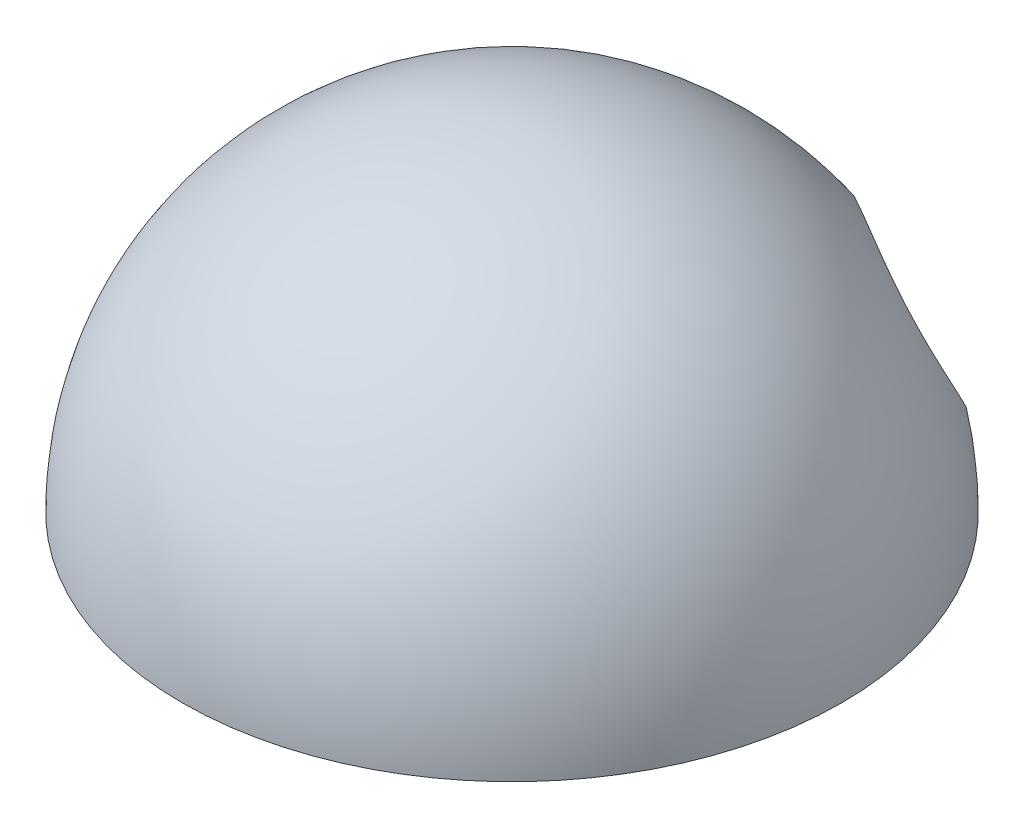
ISO-10303-21;
HEADER;
FILE_DESCRIPTION(('STEP AP214'),'2;1');
FILE_NAME('part.step','',(''),(''),'','','');
FILE_SCHEMA(('AUTOMOTIVE_DESIGN { 1 0 10303 214 1 1 1 1 }'));
ENDSEC;
DATA;
#1=APPLICATION_CONTEXT('core data for automotive mechanical design processes');
#2=APPLICATION_PROTOCOL_DEFINITION('international standard','automotive_design',2000,#1);
#3=PRODUCT_CONTEXT('',#1,'mechanical');
#4=PRODUCT('Part','Part','',(#3));
#5=PRODUCT_RELATED_PRODUCT_CATEGORY('part','',(#4));
#6=PRODUCT_DEFINITION_FORMATION('','',#4);
#7=PRODUCT_DEFINITION_CONTEXT('part definition',#1,'design');
#8=PRODUCT_DEFINITION('design','',#6,#7);
#9=PRODUCT_DEFINITION_SHAPE('','',#8);
#10=(LENGTH_UNIT() NAMED_UNIT(*) SI_UNIT(.MILLI.,.METRE.));
#11=(NAMED_UNIT(*) PLANE_ANGLE_UNIT() SI_UNIT($,.RADIAN.));
#12=(NAMED_UNIT(*) SI_UNIT($,.STERADIAN.) SOLID_ANGLE_UNIT());
#13=UNCERTAINTY_MEASURE_WITH_UNIT(LENGTH_MEASURE(1.E-05),#10,'distance_accuracy_value','');
#14=(GEOMETRIC_REPRESENTATION_CONTEXT(3) GLOBAL_UNCERTAINTY_ASSIGNED_CONTEXT((#13)) GLOBAL_UNIT_ASSIGNED_CONTEXT((#10,
#11,#12)) REPRESENTATION_CONTEXT('',''));
#15=CARTESIAN_POINT('',(0.,0.,0.));
#16=DIRECTION('',(0.,0.,1.));
#17=DIRECTION('',(1.,0.,0.));
#18=AXIS2_PLACEMENT_3D('',#15,#16,#17);
#19=CARTESIAN_POINT('',(0.,0.,0.));
#20=DIRECTION('',(0.,-1.,0.));
#21=DIRECTION('',(0.,0.,-1.));
#22=AXIS2_PLACEMENT_3D('',#19,#20,#21);
#23=PLANE('',#22);
#24=CARTESIAN_POINT('',(0.,0.,0.));
#25=DIRECTION('',(0.,-1.,0.));
#26=DIRECTION('',(0.,0.,-1.));
#27=AXIS2_PLACEMENT_3D('',#24,#25,#26);
#28=CIRCLE('',#27,32.5);
#29=CARTESIAN_POINT('',(0.,2.26946287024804E-13,-32.5));
#30=VERTEX_POINT('',#29);
#31=EDGE_CURVE('E11',#30,#30,#28,.T.);
#32=ORIENTED_EDGE('',*,*,#31,.T.);
#33=EDGE_LOOP('',(#32));
#34=FACE_BOUND('',#33,.T.);
#35=DIRECTION('',(-1.,0.,0.));
#36=VECTOR('',#35,1.);
#37=CARTESIAN_POINT('',(-31.,0.,0.));
#38=LINE('',#37,#36);
#39=CARTESIAN_POINT('',(31.,0.,0.));
#40=VERTEX_POINT('',#39);
#41=CARTESIAN_POINT('',(-31.,0.,0.));
#42=VERTEX_POINT('',#41);
#43=EDGE_CURVE('E56',#40,#42,#38,.T.);
#44=ORIENTED_EDGE('',*,*,#43,.T.);
#45=CARTESIAN_POINT('',(0.,0.,0.));
#46=DIRECTION('',(0.,1.,0.));
#47=DIRECTION('',(0.,0.,1.));
#48=AXIS2_PLACEMENT_3D('',#45,#46,#47);
#49=CIRCLE('',#48,31.);
#50=EDGE_CURVE('E65',#42,#40,#49,.T.);
#51=ORIENTED_EDGE('',*,*,#50,.T.);
#52=EDGE_LOOP('',(#44,#51));
#53=FACE_BOUND('',#52,.T.);
#54=ADVANCED_FACE('F33',(#34,#53),#23,.T.);
#55=CARTESIAN_POINT('',(0.,0.,0.));
#56=DIRECTION('',(-1.,0.,0.));
#57=DIRECTION('',(0.,0.,1.));
#58=AXIS2_PLACEMENT_3D('',#55,#56,#57);
#59=SPHERICAL_SURFACE('',#58,32.5);
#60=CARTESIAN_POINT('',(7.06318182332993,5.41689305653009,-31.2572988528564));
#61=CARTESIAN_POINT('',(7.22022770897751,5.26362528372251,-31.2483724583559));
#62=CARTESIAN_POINT('',(7.3830897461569,5.11656714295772,-31.2347396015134));
#63=CARTESIAN_POINT('',(7.71907827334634,4.83593278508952,-31.1982025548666));
#64=CARTESIAN_POINT('',(7.89220588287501,4.7023580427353,-31.1752973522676));
#65=CARTESIAN_POINT('',(8.24735063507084,4.44947766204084,-31.1204378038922));
#66=CARTESIAN_POINT('',(8.42937209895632,4.33017905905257,-31.0884790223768));
#67=CARTESIAN_POINT('',(8.8007100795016,4.10656095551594,-31.0158339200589));
#68=CARTESIAN_POINT('',(8.99002643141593,4.00224111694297,-30.9751477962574));
#69=CARTESIAN_POINT('',(9.37382142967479,3.8093033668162,-30.8855737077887));
#70=CARTESIAN_POINT('',(9.56828162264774,3.72063628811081,-30.8367123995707));
#71=CARTESIAN_POINT('',(9.96146026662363,3.55881155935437,-30.7311267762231));
#72=CARTESIAN_POINT('',(10.1601787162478,3.48565390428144,-30.6744024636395));
#73=CARTESIAN_POINT('',(10.5604106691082,3.35489611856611,-30.5535654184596));
#74=CARTESIAN_POINT('',(10.7619236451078,3.2972930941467,-30.4894540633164));
#75=CARTESIAN_POINT('',(11.1665037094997,3.19748663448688,-30.3542959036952));
#76=CARTESIAN_POINT('',(11.3695713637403,3.15528910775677,-30.2832464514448));
#77=CARTESIAN_POINT('',(11.7872542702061,3.08414737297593,-30.1305847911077));
#78=CARTESIAN_POINT('',(12.0018833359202,3.05607127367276,-30.0486048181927));
#79=CARTESIAN_POINT('',(12.4300732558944,3.01639967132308,-29.8780553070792));
#80=CARTESIAN_POINT('',(12.6436336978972,3.00481010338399,-29.7894834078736));
#81=CARTESIAN_POINT('',(13.2807703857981,2.99403870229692,-29.5147511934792));
#82=CARTESIAN_POINT('',(13.7010391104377,3.01881527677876,-29.3194874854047));
#83=CARTESIAN_POINT('',(14.5757426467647,3.1342541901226,-28.8833201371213));
#84=CARTESIAN_POINT('',(15.0277729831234,3.23285562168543,-28.6397677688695));
#85=CARTESIAN_POINT('',(15.9002162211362,3.49708222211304,-28.1331784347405));
#86=CARTESIAN_POINT('',(16.32061158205,3.66274425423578,-27.8701308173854));
#87=CARTESIAN_POINT('',(17.17898218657,4.08078181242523,-27.2916341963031));
#88=CARTESIAN_POINT('',(17.6111564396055,4.34205926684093,-26.9740095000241));
#89=CARTESIAN_POINT('',(18.4172687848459,4.93093495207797,-26.3266861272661));
#90=CARTESIAN_POINT('',(18.7911825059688,5.25856080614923,-25.9969824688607));
#91=CARTESIAN_POINT('',(19.5151117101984,6.012901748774,-25.2922654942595));
#92=CARTESIAN_POINT('',(19.8569829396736,6.4467699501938,-24.9165308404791));
#93=CARTESIAN_POINT('',(20.4520132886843,7.37430706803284,-24.166690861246));
#94=CARTESIAN_POINT('',(20.7050700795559,7.86804408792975,-23.7925879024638));
#95=CARTESIAN_POINT('',(21.0155596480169,8.65647107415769,-23.233250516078));
#96=CARTESIAN_POINT('',(21.1087583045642,8.93395148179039,-23.0429311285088));
#97=CARTESIAN_POINT('',(21.2667694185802,9.50073453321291,-22.667866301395));
#98=CARTESIAN_POINT('',(21.3315764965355,9.79003940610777,-22.4831219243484));
#99=CARTESIAN_POINT('',(21.4309260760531,10.3782636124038,-22.1218994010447));
#100=CARTESIAN_POINT('',(21.4655158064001,10.6771671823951,-21.9454087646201));
#101=CARTESIAN_POINT('',(21.50264421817,11.282859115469,-21.6033509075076));
#102=CARTESIAN_POINT('',(21.5052004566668,11.5896430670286,-21.4377777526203));
#103=CARTESIAN_POINT('',(21.4713145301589,12.3091074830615,-21.0696472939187));
#104=CARTESIAN_POINT('',(21.4220562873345,12.7240925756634,-20.8723373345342));
#105=CARTESIAN_POINT('',(21.2994467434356,13.3477337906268,-20.6027837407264));
#106=CARTESIAN_POINT('',(21.2504791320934,13.5557438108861,-20.5173567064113));
#107=CARTESIAN_POINT('',(21.1357231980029,13.9711064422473,-20.3566248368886));
#108=CARTESIAN_POINT('',(21.0699372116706,14.1784591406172,-20.281318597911));
#109=CARTESIAN_POINT('',(20.9332322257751,14.5573779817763,-20.153651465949));
#110=CARTESIAN_POINT('',(20.8648809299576,14.7292882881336,-20.099550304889));
#111=CARTESIAN_POINT('',(20.7160034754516,15.0704206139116,-20.0004172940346));
#112=CARTESIAN_POINT('',(20.6354797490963,15.2396431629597,-19.9553836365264));
#113=CARTESIAN_POINT('',(20.4623585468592,15.5741445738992,-19.8752348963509));
#114=CARTESIAN_POINT('',(20.3697659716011,15.739425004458,-19.8401158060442));
#115=CARTESIAN_POINT('',(20.172775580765,16.0648060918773,-19.7805001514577));
#116=CARTESIAN_POINT('',(20.0683776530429,16.2249066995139,-19.7560036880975));
#117=CARTESIAN_POINT('',(19.8478516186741,16.5392401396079,-19.7181058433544));
#118=CARTESIAN_POINT('',(19.7316752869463,16.6934449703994,-19.7047523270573));
#119=CARTESIAN_POINT('',(19.4887746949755,16.9939168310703,-19.689637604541));
#120=CARTESIAN_POINT('',(19.3620504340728,17.1401838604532,-19.6878763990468));
#121=CARTESIAN_POINT('',(19.099092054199,17.4235494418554,-19.6959890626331));
#122=CARTESIAN_POINT('',(18.9628581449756,17.5606481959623,-19.7058626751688));
#123=CARTESIAN_POINT('',(18.6820772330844,17.8246446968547,-19.7370059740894));
#124=CARTESIAN_POINT('',(18.5375304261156,17.9515426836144,-19.7582753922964));
#125=CARTESIAN_POINT('',(18.2513432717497,18.1862032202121,-19.8099221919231));
#126=CARTESIAN_POINT('',(18.1101573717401,18.2946782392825,-19.8395936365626));
#127=CARTESIAN_POINT('',(17.8226632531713,18.5016645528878,-19.9078787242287));
#128=CARTESIAN_POINT('',(17.6763531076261,18.600172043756,-19.9464957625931));
#129=CARTESIAN_POINT('',(17.3796664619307,18.7869232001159,-20.0320059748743));
#130=CARTESIAN_POINT('',(17.2292898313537,18.8751665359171,-20.078899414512));
#131=CARTESIAN_POINT('',(16.9253899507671,19.0413074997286,-20.1802466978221));
#132=CARTESIAN_POINT('',(16.7718661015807,19.1192031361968,-20.2347019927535));
#133=CARTESIAN_POINT('',(16.4093500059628,19.2896766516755,-20.3703307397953));
#134=CARTESIAN_POINT('',(16.1994241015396,19.3781028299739,-20.4542554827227));
#135=CARTESIAN_POINT('',(15.7771793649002,19.5366768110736,-20.6326859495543));
#136=CARTESIAN_POINT('',(15.5648599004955,19.6068196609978,-20.7271945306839));
#137=CARTESIAN_POINT('',(15.1389778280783,19.7294562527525,-20.9253173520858));
#138=CARTESIAN_POINT('',(14.9254138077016,19.7819226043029,-21.0289454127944));
#139=CARTESIAN_POINT('',(14.4985772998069,19.8696924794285,-21.2437191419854));
#140=CARTESIAN_POINT('',(14.2853048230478,19.9049953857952,-21.3548650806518));
#141=CARTESIAN_POINT('',(13.8034414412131,19.9662934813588,-21.6138074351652));
#142=CARTESIAN_POINT('',(13.5352244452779,19.9873157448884,-21.7634892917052));
#143=CARTESIAN_POINT('',(13.0024635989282,20.0041789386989,-22.0706465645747));
#144=CARTESIAN_POINT('',(12.7379208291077,20.0000126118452,-22.2281242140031));
#145=CARTESIAN_POINT('',(12.2138870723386,19.9676417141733,-22.5490339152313));
#146=CARTESIAN_POINT('',(11.9543976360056,19.9394298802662,-22.7124677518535));
#147=CARTESIAN_POINT('',(11.441831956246,19.8599861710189,-23.0436566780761));
#148=CARTESIAN_POINT('',(11.188755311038,19.8087557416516,-23.211411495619));
#149=CARTESIAN_POINT('',(10.6871595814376,19.6834221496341,-23.551952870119));
#150=CARTESIAN_POINT('',(10.4387324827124,19.609050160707,-23.7247757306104));
#151=CARTESIAN_POINT('',(9.95081749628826,19.4384683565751,-24.0722696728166));
#152=CARTESIAN_POINT('',(9.71133017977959,19.3422571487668,-24.2469408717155));
#153=CARTESIAN_POINT('',(9.24252693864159,19.1287438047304,-24.5970289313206));
#154=CARTESIAN_POINT('',(9.01321083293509,19.0114420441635,-24.7724457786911));
#155=CARTESIAN_POINT('',(8.56601429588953,18.7564471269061,-25.1230188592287));
#156=CARTESIAN_POINT('',(8.34813378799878,18.6187541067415,-25.2981750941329));
#157=CARTESIAN_POINT('',(7.90073179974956,18.3066277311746,-25.6674194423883));
#158=CARTESIAN_POINT('',(7.67276264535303,18.1297889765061,-25.8613629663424));
#159=CARTESIAN_POINT('',(7.23466649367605,17.7525583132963,-26.246464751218));
#160=CARTESIAN_POINT('',(7.02453887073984,17.5521672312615,-26.4376231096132));
#161=CARTESIAN_POINT('',(6.62410040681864,17.1287526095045,-26.8160006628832));
#162=CARTESIAN_POINT('',(6.43380114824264,16.9057159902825,-27.0032175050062));
#163=CARTESIAN_POINT('',(6.07540985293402,16.4382973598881,-27.3722954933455));
#164=CARTESIAN_POINT('',(5.90731950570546,16.1939137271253,-27.5541562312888));
#165=CARTESIAN_POINT('',(5.60091483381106,15.6936520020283,-27.905232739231));
#166=CARTESIAN_POINT('',(5.46180205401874,15.4384177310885,-28.0746677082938));
#167=CARTESIAN_POINT('',(5.20898256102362,14.9110826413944,-28.4057907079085));
#168=CARTESIAN_POINT('',(5.09526185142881,14.6389912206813,-28.5674829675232));
#169=CARTESIAN_POINT('',(4.89562739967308,14.0801322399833,-28.8815734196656));
#170=CARTESIAN_POINT('',(4.80967791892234,13.7933840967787,-29.0339833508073));
#171=CARTESIAN_POINT('',(4.66778003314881,13.2073163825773,-29.3281616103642));
#172=CARTESIAN_POINT('',(4.61182031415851,12.9080015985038,-29.4699339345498));
#173=CARTESIAN_POINT('',(4.54295610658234,12.3822691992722,-29.7043891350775));
#174=CARTESIAN_POINT('',(4.52249005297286,12.1581018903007,-29.7999560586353));
#175=CARTESIAN_POINT('',(4.4994824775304,11.7059486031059,-29.9839138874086));
#176=CARTESIAN_POINT('',(4.49693736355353,11.4779633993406,-30.0723062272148));
#177=CARTESIAN_POINT('',(4.51048634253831,11.019691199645,-30.241223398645));
#178=CARTESIAN_POINT('',(4.52657599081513,10.7894047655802,-30.3217501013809));
#179=CARTESIAN_POINT('',(4.57797187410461,10.3281242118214,-30.4742791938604));
#180=CARTESIAN_POINT('',(4.61327873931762,10.0971300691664,-30.5462813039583));
#181=CARTESIAN_POINT('',(4.70377626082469,9.63494277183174,-30.6814721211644));
#182=CARTESIAN_POINT('',(4.75908036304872,9.40375614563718,-30.7446076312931));
#183=CARTESIAN_POINT('',(4.88971651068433,8.94456068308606,-30.8609115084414));
#184=CARTESIAN_POINT('',(4.96504658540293,8.71655153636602,-30.9140808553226));
#185=CARTESIAN_POINT('',(5.13557374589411,8.26599666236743,-31.009828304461));
#186=CARTESIAN_POINT('',(5.2307554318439,8.04344684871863,-31.0524145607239));
#187=CARTESIAN_POINT('',(5.44060781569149,7.6058460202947,-31.126533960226));
#188=CARTESIAN_POINT('',(5.55527393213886,7.39079325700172,-31.1580696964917));
#189=CARTESIAN_POINT('',(5.77412992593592,7.01985931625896,-31.2036254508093));
#190=CARTESIAN_POINT('',(5.87443642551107,6.86196152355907,-31.2200208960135));
#191=CARTESIAN_POINT('',(6.08553430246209,6.55275923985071,-31.2460048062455));
#192=CARTESIAN_POINT('',(6.1963245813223,6.40145406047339,-31.2555939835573));
#193=CARTESIAN_POINT('',(6.42782090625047,6.10633377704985,-31.2678911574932));
#194=CARTESIAN_POINT('',(6.54852701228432,5.96251871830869,-31.2705991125));
#195=CARTESIAN_POINT('',(6.79913656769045,5.68325814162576,-31.2691143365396));
#196=CARTESIAN_POINT('',(6.92903742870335,5.54781028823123,-31.2649235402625));
#197=CARTESIAN_POINT('',(7.06318182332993,5.41689305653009,-31.2572988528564));
#198=B_SPLINE_CURVE_WITH_KNOTS('',3,(#60,#61,#62,#63,#64,#65,#66,#67,#68,#69,#70,#71,#72,#73,
#74,#75,#76,#77,#78,#79,#80,#81,#82,#83,#84,#85,#86,#87,#88,#89,#90,#91,#92,#93,#94,#95,#96,#97,
#98,#99,#100,#101,#102,#103,#104,#105,#106,#107,#108,#109,#110,#111,#112,#113,#114,#115,#116,
#117,#118,#119,#120,#121,#122,#123,#124,#125,#126,#127,#128,#129,#130,#131,#132,#133,#134,#135,
#136,#137,#138,#139,#140,#141,#142,#143,#144,#145,#146,#147,#148,#149,#150,#151,#152,#153,#154,
#155,#156,#157,#158,#159,#160,#161,#162,#163,#164,#165,#166,#167,#168,#169,#170,#171,#172,#173,
#174,#175,#176,#177,#178,#179,#180,#181,#182,#183,#184,#185,#186,#187,#188,#189,#190,#191,#192,
#193,#194,#195,#196,#197),.UNSPECIFIED.,.T.,.F.,(4,2,2,2,2,2,2,2,2,2,2,2,2,2,2,2,2,2,2,2,2,2,2,
2,2,2,2,2,2,2,2,2,2,2,2,2,2,2,2,2,2,2,2,2,2,2,2,2,2,2,2,2,2,2,2,2,2,2,2,2,2,2,2,2,2,2,2,2,4),
(0.,0.658685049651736,1.31744206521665,1.97652239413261,2.63558784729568,3.29254476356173,
3.94950146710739,4.60633586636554,5.26342191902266,5.95707038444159,6.65096849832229,
8.03800605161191,9.60052769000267,11.1639094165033,12.9465143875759,14.7298630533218,
16.7255150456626,18.7234588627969,19.7697403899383,20.8162200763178,21.8610612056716,
22.9053296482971,24.2856868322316,24.9754402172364,25.6650978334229,26.2427790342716,
26.8203449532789,27.3976770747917,27.9750146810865,28.5548196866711,29.1346247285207,
29.71441698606,30.2941955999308,30.8351181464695,31.3762463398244,31.9173919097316,
32.4586414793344,33.1858655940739,33.9132865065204,34.6418294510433,35.3703985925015,
36.2927458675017,37.2153588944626,38.1382507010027,39.061084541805,39.9950661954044,
40.9291074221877,41.8631320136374,42.7971503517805,43.8388127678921,44.8804386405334,
45.9226695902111,46.9649797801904,47.9729552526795,48.9803737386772,49.986490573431,
50.9922275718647,51.725145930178,52.4579173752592,53.1905140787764,53.9231348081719,
54.6599786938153,55.3967500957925,56.1329520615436,56.8689811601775,57.4318256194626,
57.9946111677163,58.557400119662,59.1200312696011),.UNSPECIFIED.);
#199=CARTESIAN_POINT('',(7.06318182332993,5.41689305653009,-31.2572988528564));
#200=VERTEX_POINT('',#199);
#201=EDGE_CURVE('E38',#200,#200,#198,.T.);
#202=ORIENTED_EDGE('',*,*,#201,.T.);
#203=EDGE_LOOP('',(#202));
#204=FACE_BOUND('',#203,.T.);
#205=CARTESIAN_POINT('',(-18.1478220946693,4.73613071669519,-26.5419595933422));
#206=CARTESIAN_POINT('',(-17.9056666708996,4.55183241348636,-26.7404169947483));
#207=CARTESIAN_POINT('',(-17.6525028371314,4.3796918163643,-26.9367676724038));
#208=CARTESIAN_POINT('',(-17.1259524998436,4.06219285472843,-27.3236564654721));
#209=CARTESIAN_POINT('',(-16.8525759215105,3.91682146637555,-27.5141973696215));
#210=CARTESIAN_POINT('',(-16.2877844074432,3.65543551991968,-27.8877650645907));
#211=CARTESIAN_POINT('',(-15.9963915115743,3.53938594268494,-28.0708005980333));
#212=CARTESIAN_POINT('',(-15.3976561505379,3.33906791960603,-28.4278776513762));
#213=CARTESIAN_POINT('',(-15.0903198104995,3.25478737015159,-28.6019225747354));
#214=CARTESIAN_POINT('',(-14.5471999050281,3.13871049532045,-28.8937304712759));
#215=CARTESIAN_POINT('',(-14.3144591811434,3.09889065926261,-29.0140187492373));
#216=CARTESIAN_POINT('',(-13.8432823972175,3.03860207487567,-29.2480853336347));
#217=CARTESIAN_POINT('',(-13.604847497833,3.01812941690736,-29.3618649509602));
#218=CARTESIAN_POINT('',(-13.1238155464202,2.99749393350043,-29.5820986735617));
#219=CARTESIAN_POINT('',(-12.8812196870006,2.9973253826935,-29.6885548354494));
#220=CARTESIAN_POINT('',(-12.3934845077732,3.01815384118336,-29.8933496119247));
#221=CARTESIAN_POINT('',(-12.1483450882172,3.03915168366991,-29.9916879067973));
#222=CARTESIAN_POINT('',(-11.6558018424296,3.10326153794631,-30.1800110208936));
#223=CARTESIAN_POINT('',(-11.4083938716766,3.1465212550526,-30.2699352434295));
#224=CARTESIAN_POINT('',(-10.9151706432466,3.25577341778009,-30.4397764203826));
#225=CARTESIAN_POINT('',(-10.6693552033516,3.32176321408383,-30.5196945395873));
#226=CARTESIAN_POINT('',(-10.1817878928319,3.47671609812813,-30.6686255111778));
#227=CARTESIAN_POINT('',(-9.94003439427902,3.56566973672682,-30.7376428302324));
#228=CARTESIAN_POINT('',(-9.46307766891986,3.76649475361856,-30.8639692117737));
#229=CARTESIAN_POINT('',(-9.22787344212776,3.87836261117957,-30.9212800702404));
#230=CARTESIAN_POINT('',(-8.79448267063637,4.10970267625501,-31.0172904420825));
#231=CARTESIAN_POINT('',(-8.59524968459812,4.22663602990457,-31.0574002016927));
#232=CARTESIAN_POINT('',(-8.20576133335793,4.4772595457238,-31.1275516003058));
#233=CARTESIAN_POINT('',(-8.01550488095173,4.6109476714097,-31.1575944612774));
#234=CARTESIAN_POINT('',(-7.64586169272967,4.89413999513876,-31.2072586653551));
#235=CARTESIAN_POINT('',(-7.46646921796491,5.04363572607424,-31.2268855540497));
#236=CARTESIAN_POINT('',(-7.12015542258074,5.35736181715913,-31.2555090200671));
#237=CARTESIAN_POINT('',(-6.95323334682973,5.52159128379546,-31.2645062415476));
#238=CARTESIAN_POINT('',(-6.64781872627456,5.8479946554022,-31.2714381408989));
#239=CARTESIAN_POINT('',(-6.50811960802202,6.00902303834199,-31.2702956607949));
#240=CARTESIAN_POINT('',(-6.24135276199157,6.34092919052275,-31.2591344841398));
#241=CARTESIAN_POINT('',(-6.11428456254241,6.5118065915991,-31.2491161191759));
#242=CARTESIAN_POINT('',(-5.87365799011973,6.86207030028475,-31.2203056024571));
#243=CARTESIAN_POINT('',(-5.76009734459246,7.04145516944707,-31.2015149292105));
#244=CARTESIAN_POINT('',(-5.54713112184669,7.40737738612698,-31.1553437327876));
#245=CARTESIAN_POINT('',(-5.44772576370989,7.59391484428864,-31.127963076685));
#246=CARTESIAN_POINT('',(-5.26467169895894,7.97041335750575,-31.0652538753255));
#247=CARTESIAN_POINT('',(-5.1808466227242,8.16030551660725,-31.0300256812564));
#248=CARTESIAN_POINT('',(-5.0277397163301,8.54435854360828,-30.9517374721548));
#249=CARTESIAN_POINT('',(-4.95846271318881,8.73852080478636,-30.9086748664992));
#250=CARTESIAN_POINT('',(-4.83460483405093,9.1296821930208,-30.8150900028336));
#251=CARTESIAN_POINT('',(-4.78002254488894,9.32668104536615,-30.7645684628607));
#252=CARTESIAN_POINT('',(-4.68549648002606,9.72225088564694,-30.6564551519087));
#253=CARTESIAN_POINT('',(-4.6455540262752,9.92082201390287,-30.5988627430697));
#254=CARTESIAN_POINT('',(-4.57818215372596,10.3301570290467,-30.4733952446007));
#255=CARTESIAN_POINT('',(-4.55164095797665,10.5409418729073,-30.4051117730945));
#256=CARTESIAN_POINT('',(-4.51444517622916,10.9615397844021,-30.2615954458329));
#257=CARTESIAN_POINT('',(-4.50379144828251,11.1713527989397,-30.1863622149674));
#258=CARTESIAN_POINT('',(-4.49790080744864,11.5887850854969,-30.0294634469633));
#259=CARTESIAN_POINT('',(-4.50266503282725,11.7964041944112,-29.9477974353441));
#260=CARTESIAN_POINT('',(-4.52705553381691,12.2083922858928,-29.7785275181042));
#261=CARTESIAN_POINT('',(-4.54668737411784,12.4127600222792,-29.6909214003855));
#262=CARTESIAN_POINT('',(-4.60316979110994,12.8396151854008,-29.5002795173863));
#263=CARTESIAN_POINT('',(-4.64168752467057,13.0616006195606,-29.3966097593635));
#264=CARTESIAN_POINT('',(-4.73539370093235,13.4990975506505,-29.1832473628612));
#265=CARTESIAN_POINT('',(-4.79058835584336,13.7146066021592,-29.0735524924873));
#266=CARTESIAN_POINT('',(-4.97979923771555,14.3498048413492,-28.7363895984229));
#267=CARTESIAN_POINT('',(-5.13746859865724,14.7583536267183,-28.5007588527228));
#268=CARTESIAN_POINT('',(-5.53370194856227,15.5921966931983,-27.979104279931));
#269=CARTESIAN_POINT('',(-5.78042417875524,16.0120280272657,-27.6906125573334));
#270=CARTESIAN_POINT('',(-6.33483840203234,16.7968489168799,-27.0980542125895));
#271=CARTESIAN_POINT('',(-6.64255867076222,17.161812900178,-26.7939804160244));
#272=CARTESIAN_POINT('',(-7.35349814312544,17.8760150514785,-26.1349021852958));
#273=CARTESIAN_POINT('',(-7.76397179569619,18.2167357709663,-25.7784948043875));
#274=CARTESIAN_POINT('',(-8.63858345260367,18.8149802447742,-25.0605471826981));
#275=CARTESIAN_POINT('',(-9.10276770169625,19.0724315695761,-24.6990027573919));
#276=CARTESIAN_POINT('',(-9.85044833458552,19.4001732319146,-24.144825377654));
#277=CARTESIAN_POINT('',(-10.1193482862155,19.5021827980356,-23.9506582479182));
#278=CARTESIAN_POINT('',(-10.6679504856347,19.6789094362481,-23.5649204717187));
#279=CARTESIAN_POINT('',(-10.9476543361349,19.7536224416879,-23.3733502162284));
#280=CARTESIAN_POINT('',(-11.5159480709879,19.8744830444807,-22.9947403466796));
#281=CARTESIAN_POINT('',(-11.80453349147,19.9206447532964,-22.807698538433));
#282=CARTESIAN_POINT('',(-12.3889534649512,19.9830977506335,-22.4401359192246));
#283=CARTESIAN_POINT('',(-12.684785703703,19.9993984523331,-22.2596130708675));
#284=CARTESIAN_POINT('',(-13.2091755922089,20.0004263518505,-21.9503846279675));
#285=CARTESIAN_POINT('',(-13.4365923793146,19.9918695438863,-21.8197565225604));
#286=CARTESIAN_POINT('',(-13.8934763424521,19.9560187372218,-21.5649592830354));
#287=CARTESIAN_POINT('',(-14.1229433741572,19.9287260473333,-21.4407896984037));
#288=CARTESIAN_POINT('',(-14.8122830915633,19.8175605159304,-21.0804162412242));
#289=CARTESIAN_POINT('',(-15.2741217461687,19.7044097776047,-20.8557346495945));
#290=CARTESIAN_POINT('',(-16.0960087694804,19.4254256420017,-20.4937795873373));
#291=CARTESIAN_POINT('',(-16.4575434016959,19.2751155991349,-20.3480282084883));
#292=CARTESIAN_POINT('',(-16.9891241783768,19.0084137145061,-20.1579581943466));
#293=CARTESIAN_POINT('',(-17.1645535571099,18.9126247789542,-20.0993551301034));
#294=CARTESIAN_POINT('',(-17.5105855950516,18.7072917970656,-19.9927463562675));
#295=CARTESIAN_POINT('',(-17.6811881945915,18.5977475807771,-19.944740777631));
#296=CARTESIAN_POINT('',(-18.0173597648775,18.3642784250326,-19.8600618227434));
#297=CARTESIAN_POINT('',(-18.182877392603,18.2402451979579,-19.823482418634));
#298=CARTESIAN_POINT('',(-18.5057933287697,17.9791465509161,-19.7630948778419));
#299=CARTESIAN_POINT('',(-18.6631916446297,17.842081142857,-19.7392867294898));
#300=CARTESIAN_POINT('',(-18.968128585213,17.5559989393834,-19.7051002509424));
#301=CARTESIAN_POINT('',(-19.1156728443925,17.4069890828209,-19.6947141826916));
#302=CARTESIAN_POINT('',(-19.3994644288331,17.0982853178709,-19.6876453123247));
#303=CARTESIAN_POINT('',(-19.5357130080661,16.9385925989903,-19.6909609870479));
#304=CARTESIAN_POINT('',(-19.7791440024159,16.6309523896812,-19.7099066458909));
#305=CARTESIAN_POINT('',(-19.887821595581,16.4840819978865,-19.7239224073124));
#306=CARTESIAN_POINT('',(-20.0949743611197,16.1844968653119,-19.7620242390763));
#307=CARTESIAN_POINT('',(-20.1934462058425,16.0317802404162,-19.7861135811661));
#308=CARTESIAN_POINT('',(-20.3796594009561,15.7217672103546,-19.8438665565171));
#309=CARTESIAN_POINT('',(-20.4674039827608,15.5644722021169,-19.8775272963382));
#310=CARTESIAN_POINT('',(-20.6319815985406,15.2463251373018,-19.9538080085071));
#311=CARTESIAN_POINT('',(-20.7088104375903,15.0854717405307,-19.9964314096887));
#312=CARTESIAN_POINT('',(-20.8531692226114,14.757393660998,-20.0910385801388));
#313=CARTESIAN_POINT('',(-20.9204306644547,14.5901088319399,-20.1432230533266));
#314=CARTESIAN_POINT('',(-21.0435031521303,14.2539323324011,-20.2554099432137));
#315=CARTESIAN_POINT('',(-21.0993097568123,14.085040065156,-20.3154153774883));
#316=CARTESIAN_POINT('',(-21.2498313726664,13.5772124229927,-20.505963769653));
#317=CARTESIAN_POINT('',(-21.3276780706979,13.2370572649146,-20.6470591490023));
#318=CARTESIAN_POINT('',(-21.4256255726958,12.6499884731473,-20.9104395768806));
#319=CARTESIAN_POINT('',(-21.4555773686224,12.402333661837,-21.0277492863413));
#320=CARTESIAN_POINT('',(-21.4936877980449,11.9100726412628,-21.2719850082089));
#321=CARTESIAN_POINT('',(-21.5018452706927,11.6654665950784,-21.3989115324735));
#322=CARTESIAN_POINT('',(-21.4974552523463,11.1803196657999,-21.6607006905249));
#323=CARTESIAN_POINT('',(-21.4848782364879,10.9397850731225,-21.7955743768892));
#324=CARTESIAN_POINT('',(-21.4400433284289,10.4642731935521,-22.0714679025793));
#325=CARTESIAN_POINT('',(-21.4077871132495,10.2292954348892,-22.2124872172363));
#326=CARTESIAN_POINT('',(-21.2816471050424,9.52704089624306,-22.6470625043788));
#327=CARTESIAN_POINT('',(-21.1584995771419,9.06936486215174,-22.9483535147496));
#328=CARTESIAN_POINT('',(-20.9212094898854,8.40817499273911,-23.4079964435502));
#329=CARTESIAN_POINT('',(-20.8333247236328,8.19195164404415,-23.5625320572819));
#330=CARTESIAN_POINT('',(-20.6406585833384,7.76845741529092,-23.8734674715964));
#331=CARTESIAN_POINT('',(-20.535876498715,7.56118691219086,-24.0298673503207));
#332=CARTESIAN_POINT('',(-20.2813512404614,7.10495158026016,-24.3835954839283));
#333=CARTESIAN_POINT('',(-20.126951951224,6.8587983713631,-24.581211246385));
#334=CARTESIAN_POINT('',(-19.7938378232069,6.38355785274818,-24.9765383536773));
#335=CARTESIAN_POINT('',(-19.6151194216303,6.15447305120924,-25.1742497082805));
#336=CARTESIAN_POINT('',(-19.2343556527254,5.71489397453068,-25.5685962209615));
#337=CARTESIAN_POINT('',(-19.0322843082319,5.50442087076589,-25.7652299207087));
#338=CARTESIAN_POINT('',(-18.6061873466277,5.10421207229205,-26.1558867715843));
#339=CARTESIAN_POINT('',(-18.3821592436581,4.914478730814,-26.3499096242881));
#340=CARTESIAN_POINT('',(-18.1478220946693,4.73613071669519,-26.5419595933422));
#341=B_SPLINE_CURVE_WITH_KNOTS('',3,(#205,#206,#207,#208,#209,#210,#211,#212,#213,#214,#215,
#216,#217,#218,#219,#220,#221,#222,#223,#224,#225,#226,#227,#228,#229,#230,#231,#232,#233,#234,
#235,#236,#237,#238,#239,#240,#241,#242,#243,#244,#245,#246,#247,#248,#249,#250,#251,#252,#253,
#254,#255,#256,#257,#258,#259,#260,#261,#262,#263,#264,#265,#266,#267,#268,#269,#270,#271,#272,
#273,#274,#275,#276,#277,#278,#279,#280,#281,#282,#283,#284,#285,#286,#287,#288,#289,#290,#291,
#292,#293,#294,#295,#296,#297,#298,#299,#300,#301,#302,#303,#304,#305,#306,#307,#308,#309,#310,
#311,#312,#313,#314,#315,#316,#317,#318,#319,#320,#321,#322,#323,#324,#325,#326,#327,#328,#329,
#330,#331,#332,#333,#334,#335,#336,#337,#338,#339,#340),.UNSPECIFIED.,.T.,.F.,(4,2,2,2,2,2,2,2,
2,2,2,2,2,2,2,2,2,2,2,2,2,2,2,2,2,2,2,2,2,2,2,2,2,2,2,2,2,2,2,2,2,2,2,2,2,2,2,2,2,2,2,2,2,2,2,2,
2,2,2,2,2,2,2,2,2,2,2,4),(0.,1.08954964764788,2.17856779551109,3.26627911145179,
4.35357560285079,5.14779486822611,5.94185360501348,6.73568843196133,7.52955450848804,
8.3287570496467,9.12786647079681,9.92664759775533,10.7253060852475,11.4277682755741,
12.1301451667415,12.8321477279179,13.5341077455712,14.1728846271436,14.8116376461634,
15.4502830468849,16.0889383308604,16.7198530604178,17.3509767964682,17.9820398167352,
18.6131598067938,19.2819151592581,19.9507066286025,20.6195474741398,21.2886387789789,
22.0318827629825,22.7754039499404,24.2618279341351,25.9532765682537,27.6455111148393,
29.5623634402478,31.4808786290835,32.5208525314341,33.5609813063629,34.6005955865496,
35.6398820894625,36.4263506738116,37.2127643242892,38.7820402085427,40.0301176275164,
40.6543226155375,41.2785353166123,41.9077542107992,42.5369725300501,43.1658279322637,
43.7946134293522,44.34369482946,44.89295470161,45.4420487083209,45.9913531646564,
46.553886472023,47.116637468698,48.2419080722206,49.0679458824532,49.8940276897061,
50.7212868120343,51.5484754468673,53.2262889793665,54.0655869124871,54.9049201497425,
55.9578355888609,57.0109054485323,58.0651581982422,59.1195304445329),.UNSPECIFIED.);
#342=CARTESIAN_POINT('',(-18.1478220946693,4.73613071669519,-26.5419595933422));
#343=VERTEX_POINT('',#342);
#344=EDGE_CURVE('E46',#343,#343,#341,.T.);
#345=ORIENTED_EDGE('',*,*,#344,.T.);
#346=EDGE_LOOP('',(#345));
#347=FACE_BOUND('',#346,.T.);
#348=ORIENTED_EDGE('',*,*,#31,.F.);
#349=EDGE_LOOP('',(#348));
#350=FACE_BOUND('',#349,.T.);
#351=ADVANCED_FACE('F35',(#204,#347,#350),#59,.T.);
#352=CARTESIAN_POINT('',(-13.,11.5,-50.));
#353=DIRECTION('',(0.,0.,1.));
#354=DIRECTION('',(1.,0.,0.));
#355=AXIS2_PLACEMENT_3D('',#352,#353,#354);
#356=CYLINDRICAL_SURFACE('',#355,8.5);
#357=CARTESIAN_POINT('',(-13.,11.5,0.));
#358=DIRECTION('',(0.,0.,-1.));
#359=DIRECTION('',(0.,1.,0.));
#360=AXIS2_PLACEMENT_3D('',#357,#358,#359);
#361=CIRCLE('',#360,8.5);
#362=CARTESIAN_POINT('',(-13.,20.,0.));
#363=VERTEX_POINT('',#362);
#364=EDGE_CURVE('E71',#363,#363,#361,.F.);
#365=ORIENTED_EDGE('',*,*,#364,.T.);
#366=EDGE_LOOP('',(#365));
#367=FACE_BOUND('',#366,.T.);
#368=ORIENTED_EDGE('',*,*,#344,.F.);
#369=EDGE_LOOP('',(#368));
#370=FACE_BOUND('',#369,.T.);
#371=ADVANCED_FACE('F77',(#367,#370),#356,.F.);
#372=CARTESIAN_POINT('',(13.,11.5,-50.));
#373=DIRECTION('',(0.,0.,1.));
#374=DIRECTION('',(1.,0.,0.));
#375=AXIS2_PLACEMENT_3D('',#372,#373,#374);
#376=CYLINDRICAL_SURFACE('',#375,8.5);
#377=CARTESIAN_POINT('',(13.,11.5,0.));
#378=DIRECTION('',(0.,0.,-1.));
#379=DIRECTION('',(0.,1.,0.));
#380=AXIS2_PLACEMENT_3D('',#377,#378,#379);
#381=CIRCLE('',#380,8.5);
#382=CARTESIAN_POINT('',(13.,20.,0.));
#383=VERTEX_POINT('',#382);
#384=EDGE_CURVE('E61',#383,#383,#381,.F.);
#385=ORIENTED_EDGE('',*,*,#384,.T.);
#386=EDGE_LOOP('',(#385));
#387=FACE_BOUND('',#386,.T.);
#388=ORIENTED_EDGE('',*,*,#201,.F.);
#389=EDGE_LOOP('',(#388));
#390=FACE_BOUND('',#389,.T.);
#391=ADVANCED_FACE('F80',(#387,#390),#376,.F.);
#392=CARTESIAN_POINT('',(0.,0.,0.));
#393=DIRECTION('',(0.,0.,-1.));
#394=DIRECTION('',(0.,1.,0.));
#395=AXIS2_PLACEMENT_3D('',#392,#393,#394);
#396=PLANE('',#395);
#397=ORIENTED_EDGE('',*,*,#384,.F.);
#398=EDGE_LOOP('',(#397));
#399=FACE_BOUND('',#398,.T.);
#400=CARTESIAN_POINT('',(0.,0.,0.));
#401=DIRECTION('',(0.,0.,-1.));
#402=DIRECTION('',(0.,1.,0.));
#403=AXIS2_PLACEMENT_3D('',#400,#401,#402);
#404=CIRCLE('',#403,31.);
#405=EDGE_CURVE('E53',#42,#40,#404,.T.);
#406=ORIENTED_EDGE('',*,*,#405,.F.);
#407=ORIENTED_EDGE('',*,*,#43,.F.);
#408=EDGE_LOOP('',(#406,#407));
#409=FACE_BOUND('',#408,.T.);
#410=ORIENTED_EDGE('',*,*,#364,.F.);
#411=EDGE_LOOP('',(#410));
#412=FACE_BOUND('',#411,.T.);
#413=ADVANCED_FACE('F57',(#399,#409,#412),#396,.F.);
#414=CARTESIAN_POINT('',(0.,0.,0.));
#415=DIRECTION('',(1.,0.,0.));
#416=DIRECTION('',(0.,1.,0.));
#417=AXIS2_PLACEMENT_3D('',#414,#415,#416);
#418=SPHERICAL_SURFACE('',#417,31.);
#419=ORIENTED_EDGE('',*,*,#50,.F.);
#420=ORIENTED_EDGE('',*,*,#405,.T.);
#421=EDGE_LOOP('',(#419,#420));
#422=FACE_BOUND('',#421,.T.);
#423=ADVANCED_FACE('F64',(#422),#418,.F.);
#424=CLOSED_SHELL('',(#54,#351,#371,#391,#413,#423));
#425=MANIFOLD_SOLID_BREP('B2',#424);
#426=ADVANCED_BREP_SHAPE_REPRESENTATION('',(#18,#425),#14);
#427=SHAPE_DEFINITION_REPRESENTATION(#9,#426);
ENDSEC;
END-ISO-10303-21;
